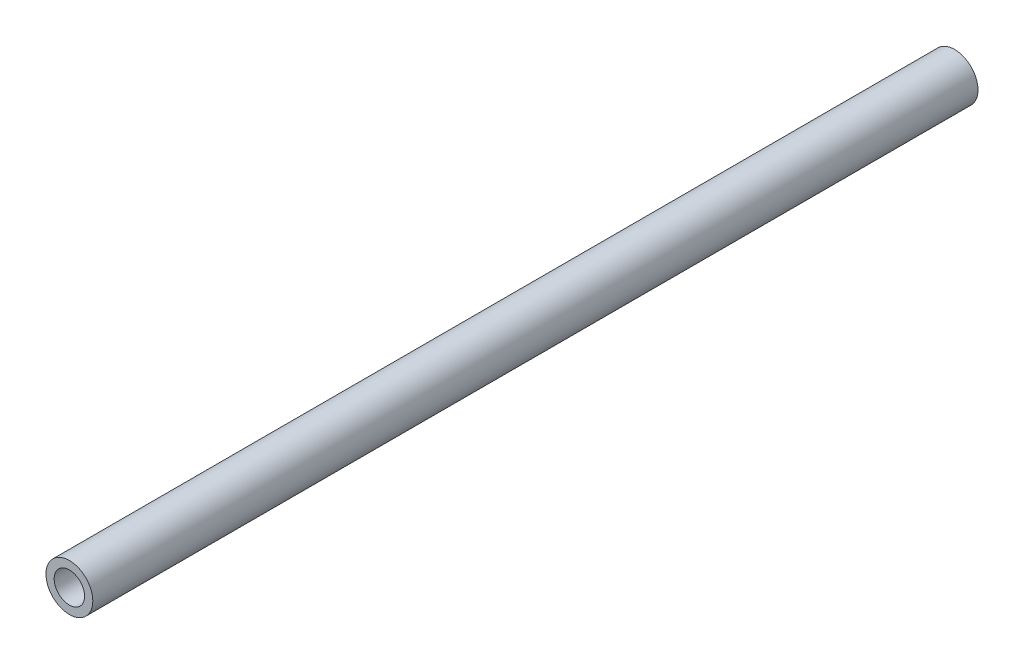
ISO-10303-21;
HEADER;
FILE_DESCRIPTION(('STEP AP214'),'2;1');
FILE_NAME('part.step','',(''),(''),'','','');
FILE_SCHEMA(('AUTOMOTIVE_DESIGN { 1 0 10303 214 1 1 1 1 }'));
ENDSEC;
DATA;
#1=APPLICATION_CONTEXT('core data for automotive mechanical design processes');
#2=APPLICATION_PROTOCOL_DEFINITION('international standard','automotive_design',2000,#1);
#3=PRODUCT_CONTEXT('',#1,'mechanical');
#4=PRODUCT('Part','Part','',(#3));
#5=PRODUCT_RELATED_PRODUCT_CATEGORY('part','',(#4));
#6=PRODUCT_DEFINITION_FORMATION('','',#4);
#7=PRODUCT_DEFINITION_CONTEXT('part definition',#1,'design');
#8=PRODUCT_DEFINITION('design','',#6,#7);
#9=PRODUCT_DEFINITION_SHAPE('','',#8);
#10=(LENGTH_UNIT() NAMED_UNIT(*) SI_UNIT(.MILLI.,.METRE.));
#11=(NAMED_UNIT(*) PLANE_ANGLE_UNIT() SI_UNIT($,.RADIAN.));
#12=(NAMED_UNIT(*) SI_UNIT($,.STERADIAN.) SOLID_ANGLE_UNIT());
#13=UNCERTAINTY_MEASURE_WITH_UNIT(LENGTH_MEASURE(1.E-05),#10,'distance_accuracy_value','');
#14=(GEOMETRIC_REPRESENTATION_CONTEXT(3) GLOBAL_UNCERTAINTY_ASSIGNED_CONTEXT((#13)) GLOBAL_UNIT_ASSIGNED_CONTEXT((#10,
#11,#12)) REPRESENTATION_CONTEXT('',''));
#15=CARTESIAN_POINT('',(0.,0.,0.));
#16=DIRECTION('',(0.,0.,1.));
#17=DIRECTION('',(1.,0.,0.));
#18=AXIS2_PLACEMENT_3D('',#15,#16,#17);
#19=CARTESIAN_POINT('',(0.,0.,189.));
#20=DIRECTION('',(0.,0.,1.));
#21=DIRECTION('',(1.,0.,0.));
#22=AXIS2_PLACEMENT_3D('',#19,#20,#21);
#23=PLANE('',#22);
#24=CARTESIAN_POINT('',(0.,0.,189.));
#25=DIRECTION('',(0.,0.,1.));
#26=DIRECTION('',(1.,0.,0.));
#27=AXIS2_PLACEMENT_3D('',#24,#25,#26);
#28=CIRCLE('',#27,5.);
#29=CARTESIAN_POINT('',(5.,0.,189.));
#30=VERTEX_POINT('',#29);
#31=EDGE_CURVE('E10',#30,#30,#28,.T.);
#32=ORIENTED_EDGE('',*,*,#31,.T.);
#33=EDGE_LOOP('',(#32));
#34=FACE_BOUND('',#33,.T.);
#35=CARTESIAN_POINT('',(0.,0.,189.));
#36=DIRECTION('',(0.,0.,1.));
#37=DIRECTION('',(1.,0.,0.));
#38=AXIS2_PLACEMENT_3D('',#35,#36,#37);
#39=CIRCLE('',#38,3.25);
#40=CARTESIAN_POINT('',(3.25,0.,189.));
#41=VERTEX_POINT('',#40);
#42=EDGE_CURVE('E40',#41,#41,#39,.T.);
#43=ORIENTED_EDGE('',*,*,#42,.F.);
#44=EDGE_LOOP('',(#43));
#45=FACE_BOUND('',#44,.T.);
#46=ADVANCED_FACE('F29',(#34,#45),#23,.T.);
#47=CARTESIAN_POINT('',(0.,0.,0.));
#48=DIRECTION('',(0.,0.,1.));
#49=DIRECTION('',(1.,0.,0.));
#50=AXIS2_PLACEMENT_3D('',#47,#48,#49);
#51=PLANE('',#50);
#52=CARTESIAN_POINT('',(0.,0.,0.));
#53=DIRECTION('',(0.,0.,1.));
#54=DIRECTION('',(1.,0.,0.));
#55=AXIS2_PLACEMENT_3D('',#52,#53,#54);
#56=CIRCLE('',#55,5.);
#57=CARTESIAN_POINT('',(5.,0.,0.));
#58=VERTEX_POINT('',#57);
#59=EDGE_CURVE('E33',#58,#58,#56,.T.);
#60=ORIENTED_EDGE('',*,*,#59,.F.);
#61=EDGE_LOOP('',(#60));
#62=FACE_BOUND('',#61,.T.);
#63=CARTESIAN_POINT('',(0.,0.,0.));
#64=DIRECTION('',(0.,0.,1.));
#65=DIRECTION('',(1.,0.,0.));
#66=AXIS2_PLACEMENT_3D('',#63,#64,#65);
#67=CIRCLE('',#66,3.25);
#68=CARTESIAN_POINT('',(3.25,0.,0.));
#69=VERTEX_POINT('',#68);
#70=EDGE_CURVE('E42',#69,#69,#67,.T.);
#71=ORIENTED_EDGE('',*,*,#70,.T.);
#72=EDGE_LOOP('',(#71));
#73=FACE_BOUND('',#72,.T.);
#74=ADVANCED_FACE('F52',(#62,#73),#51,.F.);
#75=CARTESIAN_POINT('',(0.,0.,189.));
#76=DIRECTION('',(0.,0.,-1.));
#77=DIRECTION('',(-1.,0.,0.));
#78=AXIS2_PLACEMENT_3D('',#75,#76,#77);
#79=CYLINDRICAL_SURFACE('',#78,5.);
#80=ORIENTED_EDGE('',*,*,#31,.F.);
#81=EDGE_LOOP('',(#80));
#82=FACE_BOUND('',#81,.T.);
#83=ORIENTED_EDGE('',*,*,#59,.T.);
#84=EDGE_LOOP('',(#83));
#85=FACE_BOUND('',#84,.T.);
#86=ADVANCED_FACE('F31',(#82,#85),#79,.T.);
#87=CARTESIAN_POINT('',(0.,0.,189.));
#88=DIRECTION('',(0.,0.,-1.));
#89=DIRECTION('',(-1.,0.,0.));
#90=AXIS2_PLACEMENT_3D('',#87,#88,#89);
#91=CYLINDRICAL_SURFACE('',#90,3.25);
#92=ORIENTED_EDGE('',*,*,#42,.T.);
#93=EDGE_LOOP('',(#92));
#94=FACE_BOUND('',#93,.T.);
#95=ORIENTED_EDGE('',*,*,#70,.F.);
#96=EDGE_LOOP('',(#95));
#97=FACE_BOUND('',#96,.T.);
#98=ADVANCED_FACE('F48',(#94,#97),#91,.F.);
#99=CLOSED_SHELL('',(#46,#74,#86,#98));
#100=MANIFOLD_SOLID_BREP('B2',#99);
#101=ADVANCED_BREP_SHAPE_REPRESENTATION('',(#18,#100),#14);
#102=SHAPE_DEFINITION_REPRESENTATION(#9,#101);
ENDSEC;
END-ISO-10303-21;
